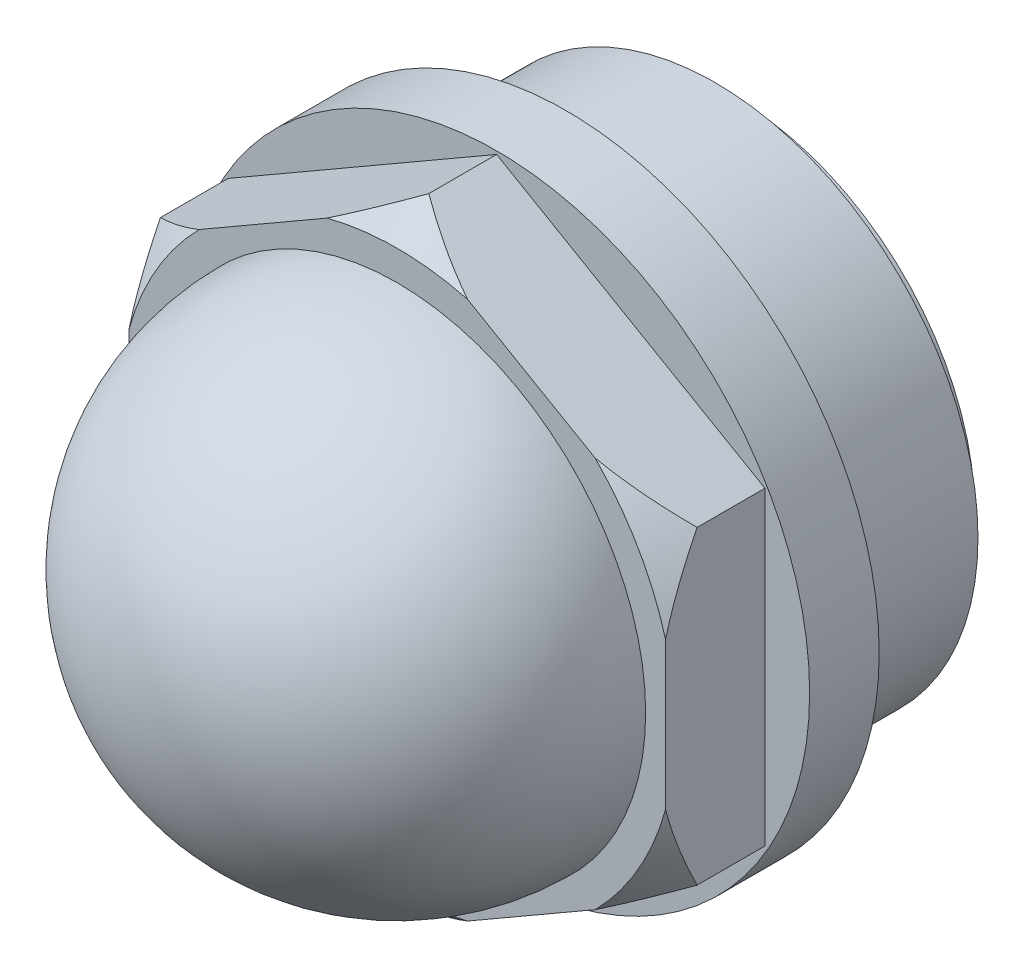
ISO-10303-21;
HEADER;
FILE_DESCRIPTION(('STEP AP214'),'2;1');
FILE_NAME('part.step','',(''),(''),'','','');
FILE_SCHEMA(('AUTOMOTIVE_DESIGN { 1 0 10303 214 1 1 1 1 }'));
ENDSEC;
DATA;
#1=APPLICATION_CONTEXT('core data for automotive mechanical design processes');
#2=APPLICATION_PROTOCOL_DEFINITION('international standard','automotive_design',2000,#1);
#3=PRODUCT_CONTEXT('',#1,'mechanical');
#4=PRODUCT('Part','Part','',(#3));
#5=PRODUCT_RELATED_PRODUCT_CATEGORY('part','',(#4));
#6=PRODUCT_DEFINITION_FORMATION('','',#4);
#7=PRODUCT_DEFINITION_CONTEXT('part definition',#1,'design');
#8=PRODUCT_DEFINITION('design','',#6,#7);
#9=PRODUCT_DEFINITION_SHAPE('','',#8);
#10=(LENGTH_UNIT() NAMED_UNIT(*) SI_UNIT(.MILLI.,.METRE.));
#11=(NAMED_UNIT(*) PLANE_ANGLE_UNIT() SI_UNIT($,.RADIAN.));
#12=(NAMED_UNIT(*) SI_UNIT($,.STERADIAN.) SOLID_ANGLE_UNIT());
#13=UNCERTAINTY_MEASURE_WITH_UNIT(LENGTH_MEASURE(1.E-05),#10,'distance_accuracy_value','');
#14=(GEOMETRIC_REPRESENTATION_CONTEXT(3) GLOBAL_UNCERTAINTY_ASSIGNED_CONTEXT((#13)) GLOBAL_UNIT_ASSIGNED_CONTEXT((#10,
#11,#12)) REPRESENTATION_CONTEXT('',''));
#15=CARTESIAN_POINT('',(0.,0.,0.));
#16=DIRECTION('',(0.,0.,1.));
#17=DIRECTION('',(1.,0.,0.));
#18=AXIS2_PLACEMENT_3D('',#15,#16,#17);
#19=CARTESIAN_POINT('',(0.,0.,-14.5));
#20=DIRECTION('',(0.,0.,-1.));
#21=DIRECTION('',(1.,0.,0.));
#22=AXIS2_PLACEMENT_3D('',#19,#20,#21);
#23=CYLINDRICAL_SURFACE('',#22,15.75);
#24=CARTESIAN_POINT('',(0.,0.,0.));
#25=DIRECTION('',(0.,0.,-1.));
#26=DIRECTION('',(1.,0.,0.));
#27=AXIS2_PLACEMENT_3D('',#24,#25,#26);
#28=CIRCLE('',#27,15.75);
#29=CARTESIAN_POINT('',(15.75,0.,0.));
#30=VERTEX_POINT('',#29);
#31=EDGE_CURVE('E259',#30,#30,#28,.T.);
#32=ORIENTED_EDGE('',*,*,#31,.F.);
#33=EDGE_LOOP('',(#32));
#34=FACE_BOUND('',#33,.T.);
#35=CARTESIAN_POINT('',(0.,0.,3.5));
#36=DIRECTION('',(0.,0.,-1.));
#37=DIRECTION('',(1.,0.,0.));
#38=AXIS2_PLACEMENT_3D('',#35,#36,#37);
#39=CIRCLE('',#38,15.7499999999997);
#40=CARTESIAN_POINT('',(15.7499999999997,0.,3.5));
#41=VERTEX_POINT('',#40);
#42=EDGE_CURVE('E9',#41,#41,#39,.T.);
#43=ORIENTED_EDGE('',*,*,#42,.T.);
#44=EDGE_LOOP('',(#43));
#45=FACE_BOUND('',#44,.T.);
#46=ADVANCED_FACE('F14',(#34,#45),#23,.T.);
#47=CARTESIAN_POINT('',(0.,-15.58845726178,3.5));
#48=DIRECTION('',(0.,0.,-1.));
#49=DIRECTION('',(1.,0.,0.));
#50=AXIS2_PLACEMENT_3D('',#47,#48,#49);
#51=PLANE('',#50);
#52=ORIENTED_EDGE('',*,*,#42,.F.);
#53=EDGE_LOOP('',(#52));
#54=FACE_BOUND('',#53,.T.);
#55=DIRECTION('',(0.,-1.,0.));
#56=VECTOR('',#55,1.);
#57=CARTESIAN_POINT('',(13.4999999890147,7.79422862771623,3.5));
#58=LINE('',#57,#56);
#59=CARTESIAN_POINT('',(13.4999999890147,7.79422862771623,3.5));
#60=VERTEX_POINT('',#59);
#61=CARTESIAN_POINT('',(13.4999999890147,-7.79422862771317,3.5));
#62=VERTEX_POINT('',#61);
#63=EDGE_CURVE('E123',#60,#62,#58,.T.);
#64=ORIENTED_EDGE('',*,*,#63,.T.);
#65=DIRECTION('',(-0.866025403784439,-0.5,0.));
#66=VECTOR('',#65,1.);
#67=CARTESIAN_POINT('',(13.4999999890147,-7.79422862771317,3.5));
#68=LINE('',#67,#66);
#69=CARTESIAN_POINT('',(6.93889390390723E-12,-15.588457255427,3.5));
#70=VERTEX_POINT('',#69);
#71=EDGE_CURVE('E108',#62,#70,#68,.T.);
#72=ORIENTED_EDGE('',*,*,#71,.T.);
#73=DIRECTION('',(-0.866025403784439,0.5,0.));
#74=VECTOR('',#73,1.);
#75=CARTESIAN_POINT('',(6.93889390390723E-12,-15.588457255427,3.5));
#76=LINE('',#75,#74);
#77=CARTESIAN_POINT('',(-13.4999999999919,-7.79422862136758,3.5));
#78=VERTEX_POINT('',#77);
#79=EDGE_CURVE('E120',#70,#78,#76,.T.);
#80=ORIENTED_EDGE('',*,*,#79,.T.);
#81=DIRECTION('',(7.05454887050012E-10,1.,0.));
#82=VECTOR('',#81,1.);
#83=CARTESIAN_POINT('',(-13.4999999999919,-7.79422862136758,3.5));
#84=LINE('',#83,#82);
#85=CARTESIAN_POINT('',(-13.500000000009,7.79422862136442,3.5));
#86=VERTEX_POINT('',#85);
#87=EDGE_CURVE('E128',#78,#86,#84,.T.);
#88=ORIENTED_EDGE('',*,*,#87,.T.);
#89=DIRECTION('',(0.866025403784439,0.5,0.));
#90=VECTOR('',#89,1.);
#91=CARTESIAN_POINT('',(-13.4999999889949,7.79422862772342,3.5));
#92=LINE('',#91,#90);
#93=CARTESIAN_POINT('',(3.60822483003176E-12,15.5884572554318,3.5));
#94=VERTEX_POINT('',#93);
#95=EDGE_CURVE('E28',#86,#94,#92,.T.);
#96=ORIENTED_EDGE('',*,*,#95,.T.);
#97=DIRECTION('',(0.866025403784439,-0.5,0.));
#98=VECTOR('',#97,1.);
#99=CARTESIAN_POINT('',(3.60822483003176E-12,15.5884572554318,3.5));
#100=LINE('',#99,#98);
#101=EDGE_CURVE('E134',#94,#60,#100,.T.);
#102=ORIENTED_EDGE('',*,*,#101,.T.);
#103=EDGE_LOOP('',(#64,#72,#80,#88,#96,#102));
#104=FACE_BOUND('',#103,.T.);
#105=ADVANCED_FACE('F119',(#54,#104),#51,.F.);
#106=CARTESIAN_POINT('',(0.,0.,-8.5));
#107=DIRECTION('',(0.,0.,-1.));
#108=DIRECTION('',(1.,0.,0.));
#109=AXIS2_PLACEMENT_3D('',#106,#107,#108);
#110=PLANE('',#109);
#111=CARTESIAN_POINT('',(0.,0.,-8.5));
#112=DIRECTION('',(0.,0.,-1.));
#113=DIRECTION('',(1.,0.,0.));
#114=AXIS2_PLACEMENT_3D('',#111,#112,#113);
#115=CIRCLE('',#114,12.0585);
#116=CARTESIAN_POINT('',(12.0585,0.,-8.5));
#117=VERTEX_POINT('',#116);
#118=EDGE_CURVE('E272',#117,#117,#115,.T.);
#119=ORIENTED_EDGE('',*,*,#118,.T.);
#120=EDGE_LOOP('',(#119));
#121=FACE_BOUND('',#120,.T.);
#122=ADVANCED_FACE('F254',(#121),#110,.T.);
#123=CARTESIAN_POINT('',(0.,0.,-14.5));
#124=DIRECTION('',(0.,0.,-1.));
#125=DIRECTION('',(1.,0.,0.));
#126=AXIS2_PLACEMENT_3D('',#123,#124,#125);
#127=CYLINDRICAL_SURFACE('',#126,12.0585);
#128=ORIENTED_EDGE('',*,*,#118,.F.);
#129=EDGE_LOOP('',(#128));
#130=FACE_BOUND('',#129,.T.);
#131=CARTESIAN_POINT('',(0.,0.,-7.5));
#132=DIRECTION('',(0.,0.,-1.));
#133=DIRECTION('',(1.,0.,0.));
#134=AXIS2_PLACEMENT_3D('',#131,#132,#133);
#135=CIRCLE('',#134,12.0585);
#136=CARTESIAN_POINT('',(12.0585,0.,-7.5));
#137=VERTEX_POINT('',#136);
#138=EDGE_CURVE('E269',#137,#137,#135,.T.);
#139=ORIENTED_EDGE('',*,*,#138,.T.);
#140=EDGE_LOOP('',(#139));
#141=FACE_BOUND('',#140,.T.);
#142=ADVANCED_FACE('F350',(#130,#141),#127,.T.);
#143=CARTESIAN_POINT('',(0.,-12.0585,-7.5));
#144=DIRECTION('',(0.,0.,-1.));
#145=DIRECTION('',(1.,0.,0.));
#146=AXIS2_PLACEMENT_3D('',#143,#144,#145);
#147=PLANE('',#146);
#148=CARTESIAN_POINT('',(0.,0.,-7.5));
#149=DIRECTION('',(0.,0.,-1.));
#150=DIRECTION('',(1.,0.,0.));
#151=AXIS2_PLACEMENT_3D('',#148,#149,#150);
#152=CIRCLE('',#151,13.2205);
#153=CARTESIAN_POINT('',(13.2205,0.,-7.5));
#154=VERTEX_POINT('',#153);
#155=EDGE_CURVE('E264',#154,#154,#152,.T.);
#156=ORIENTED_EDGE('',*,*,#155,.T.);
#157=EDGE_LOOP('',(#156));
#158=FACE_BOUND('',#157,.T.);
#159=ORIENTED_EDGE('',*,*,#138,.F.);
#160=EDGE_LOOP('',(#159));
#161=FACE_BOUND('',#160,.T.);
#162=ADVANCED_FACE('F346',(#158,#161),#147,.T.);
#163=CARTESIAN_POINT('',(0.,0.,-14.5));
#164=DIRECTION('',(0.,0.,-1.));
#165=DIRECTION('',(1.,0.,0.));
#166=AXIS2_PLACEMENT_3D('',#163,#164,#165);
#167=CYLINDRICAL_SURFACE('',#166,13.2205);
#168=ORIENTED_EDGE('',*,*,#155,.F.);
#169=EDGE_LOOP('',(#168));
#170=FACE_BOUND('',#169,.T.);
#171=CARTESIAN_POINT('',(0.,0.,0.));
#172=DIRECTION('',(0.,0.,-1.));
#173=DIRECTION('',(1.,0.,0.));
#174=AXIS2_PLACEMENT_3D('',#171,#172,#173);
#175=CIRCLE('',#174,13.2205);
#176=CARTESIAN_POINT('',(13.2205,0.,0.));
#177=VERTEX_POINT('',#176);
#178=EDGE_CURVE('E262',#177,#177,#175,.T.);
#179=ORIENTED_EDGE('',*,*,#178,.T.);
#180=EDGE_LOOP('',(#179));
#181=FACE_BOUND('',#180,.T.);
#182=ADVANCED_FACE('F245',(#170,#181),#167,.T.);
#183=CARTESIAN_POINT('',(0.,-15.75,0.));
#184=DIRECTION('',(0.,0.,1.));
#185=DIRECTION('',(-1.,0.,0.));
#186=AXIS2_PLACEMENT_3D('',#183,#184,#185);
#187=PLANE('',#186);
#188=ORIENTED_EDGE('',*,*,#178,.F.);
#189=EDGE_LOOP('',(#188));
#190=FACE_BOUND('',#189,.T.);
#191=ORIENTED_EDGE('',*,*,#31,.T.);
#192=EDGE_LOOP('',(#191));
#193=FACE_BOUND('',#192,.T.);
#194=ADVANCED_FACE('F236',(#190,#193),#187,.F.);
#195=CARTESIAN_POINT('',(13.4999999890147,-7.79422862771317,3.5));
#196=DIRECTION('',(-0.5,0.866025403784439,0.));
#197=DIRECTION('',(0.866025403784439,0.5,0.));
#198=AXIS2_PLACEMENT_3D('',#195,#196,#197);
#199=PLANE('',#198);
#200=DIRECTION('',(0.,0.,1.));
#201=VECTOR('',#200,1.);
#202=CARTESIAN_POINT('',(6.93889390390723E-12,-15.588457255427,3.5));
#203=LINE('',#202,#201);
#204=CARTESIAN_POINT('',(6.93889390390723E-12,-15.588457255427,6.91154274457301));
#205=VERTEX_POINT('',#204);
#206=EDGE_CURVE('E104',#70,#205,#203,.T.);
#207=ORIENTED_EDGE('',*,*,#206,.F.);
#208=ORIENTED_EDGE('',*,*,#71,.F.);
#209=DIRECTION('',(0.,0.,1.));
#210=VECTOR('',#209,1.);
#211=CARTESIAN_POINT('',(13.4999999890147,-7.79422862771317,3.5));
#212=LINE('',#211,#210);
#213=CARTESIAN_POINT('',(13.4999999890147,-7.79422862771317,6.91154274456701));
#214=VERTEX_POINT('',#213);
#215=EDGE_CURVE('E137',#62,#214,#212,.T.);
#216=ORIENTED_EDGE('',*,*,#215,.T.);
#217=CARTESIAN_POINT('',(9.96065417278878,-9.83767088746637,8.5002));
#218=CARTESIAN_POINT('',(10.2676733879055,-9.66041326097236,8.40632414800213));
#219=CARTESIAN_POINT('',(10.5718571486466,-9.48479268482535,8.30078239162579));
#220=CARTESIAN_POINT('',(11.1736119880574,-9.1373693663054,8.06968134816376));
#221=CARTESIAN_POINT('',(11.4711982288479,-8.96555787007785,7.94417492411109));
#222=CARTESIAN_POINT('',(12.0602807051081,-8.62545094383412,7.67600050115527));
#223=CARTESIAN_POINT('',(12.3517797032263,-8.45715391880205,7.53334049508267));
#224=CARTESIAN_POINT('',(12.9298395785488,-8.12341089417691,7.23297953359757));
#225=CARTESIAN_POINT('',(13.2163855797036,-7.95797348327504,7.07524028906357));
#226=CARTESIAN_POINT('',(13.5001999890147,-7.79411315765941,6.91142727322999));
#227=B_SPLINE_CURVE_WITH_KNOTS('',3,(#217,#218,#219,#220,#221,#222,#223,#224,#225,#226),
.UNSPECIFIED.,.F.,.F.,(4,2,2,2,4),(0.,1.09974635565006,2.19662781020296,3.29300013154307,
4.39223429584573),.UNSPECIFIED.);
#228=CARTESIAN_POINT('',(9.96130817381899,-9.83729329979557,8.5));
#229=VERTEX_POINT('',#228);
#230=EDGE_CURVE('E223',#229,#214,#227,.T.);
#231=ORIENTED_EDGE('',*,*,#230,.F.);
#232=DIRECTION('',(-0.866025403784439,-0.5,0.));
#233=VECTOR('',#232,1.);
#234=CARTESIAN_POINT('',(13.4999999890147,-7.79422862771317,8.5));
#235=LINE('',#234,#233);
#236=CARTESIAN_POINT('',(3.53869181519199,-13.5453925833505,8.5));
#237=VERTEX_POINT('',#236);
#238=EDGE_CURVE('E319',#229,#237,#235,.T.);
#239=ORIENTED_EDGE('',*,*,#238,.T.);
#240=CARTESIAN_POINT('',(-0.000199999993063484,-15.588572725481,6.91142727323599));
#241=CARTESIAN_POINT('',(0.28361440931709,-15.4247123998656,7.07524028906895));
#242=CARTESIAN_POINT('',(0.570160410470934,-15.2592749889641,7.23297953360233));
#243=CARTESIAN_POINT('',(1.14822028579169,-14.9255319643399,7.53334049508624));
#244=CARTESIAN_POINT('',(1.43971928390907,-14.7572349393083,7.67600050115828));
#245=CARTESIAN_POINT('',(2.02880176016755,-14.4171280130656,7.94417492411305));
#246=CARTESIAN_POINT('',(2.32638800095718,-14.2453165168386,8.06968134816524));
#247=CARTESIAN_POINT('',(2.92814284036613,-13.8978931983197,8.30078239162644));
#248=CARTESIAN_POINT('',(3.23232660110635,-13.7222726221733,8.40632414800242));
#249=CARTESIAN_POINT('',(3.53934581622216,-13.54501499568,8.5002));
#250=B_SPLINE_CURVE_WITH_KNOTS('',3,(#240,#241,#242,#243,#244,#245,#246,#247,#248,#249),
.UNSPECIFIED.,.F.,.F.,(4,2,2,2,4),(0.,1.09923416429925,2.19560648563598,3.29248794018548,
4.39223429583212),.UNSPECIFIED.);
#251=EDGE_CURVE('E110',#205,#237,#250,.T.);
#252=ORIENTED_EDGE('',*,*,#251,.F.);
#253=EDGE_LOOP('',(#207,#208,#216,#231,#239,#252));
#254=FACE_BOUND('',#253,.T.);
#255=ADVANCED_FACE('F106',(#254),#199,.F.);
#256=CARTESIAN_POINT('',(6.93889390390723E-12,-15.588457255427,3.5));
#257=DIRECTION('',(0.5,0.866025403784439,0.));
#258=DIRECTION('',(0.866025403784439,-0.5,0.));
#259=AXIS2_PLACEMENT_3D('',#256,#257,#258);
#260=PLANE('',#259);
#261=DIRECTION('',(0.,0.,1.));
#262=VECTOR('',#261,1.);
#263=CARTESIAN_POINT('',(-13.4999999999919,-7.79422862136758,3.5));
#264=LINE('',#263,#262);
#265=CARTESIAN_POINT('',(-13.4999999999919,-7.79422862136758,6.911542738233));
#266=VERTEX_POINT('',#265);
#267=EDGE_CURVE('E114',#78,#266,#264,.T.);
#268=ORIENTED_EDGE('',*,*,#267,.F.);
#269=ORIENTED_EDGE('',*,*,#79,.F.);
#270=ORIENTED_EDGE('',*,*,#206,.T.);
#271=CARTESIAN_POINT('',(-3.53934581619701,-13.5450149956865,8.5002));
#272=CARTESIAN_POINT('',(-3.23232660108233,-13.7222726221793,8.406324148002));
#273=CARTESIAN_POINT('',(-2.92814284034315,-13.8978931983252,8.30078239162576));
#274=CARTESIAN_POINT('',(-2.32638800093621,-14.245316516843,8.06968134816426));
#275=CARTESIAN_POINT('',(-2.02880176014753,-14.4171280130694,7.94417492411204));
#276=CARTESIAN_POINT('',(-1.43971928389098,-14.7572349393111,7.67600050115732));
#277=CARTESIAN_POINT('',(-1.14822028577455,-14.9255319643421,7.53334049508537));
#278=CARTESIAN_POINT('',(-0.570160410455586,-15.2592749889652,7.23297953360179));
#279=CARTESIAN_POINT('',(-0.283614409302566,-15.424712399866,7.07524028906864));
#280=CARTESIAN_POINT('',(0.000200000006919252,-15.5885727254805,6.91142727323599));
#281=B_SPLINE_CURVE_WITH_KNOTS('',3,(#271,#272,#273,#274,#275,#276,#277,#278,#279,#280),
.UNSPECIFIED.,.F.,.F.,(4,2,2,2,4),(0.,1.09974635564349,2.19662781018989,3.29300013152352,
4.39223429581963),.UNSPECIFIED.);
#282=CARTESIAN_POINT('',(-3.53869181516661,-13.5453925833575,8.5));
#283=VERTEX_POINT('',#282);
#284=EDGE_CURVE('E210',#283,#205,#281,.T.);
#285=ORIENTED_EDGE('',*,*,#284,.F.);
#286=DIRECTION('',(-0.866025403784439,0.5,0.));
#287=VECTOR('',#286,1.);
#288=CARTESIAN_POINT('',(6.93889390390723E-12,-15.588457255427,8.5));
#289=LINE('',#288,#287);
#290=CARTESIAN_POINT('',(-9.96130817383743,-9.83729329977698,8.5));
#291=VERTEX_POINT('',#290);
#292=EDGE_CURVE('E311',#283,#291,#289,.T.);
#293=ORIENTED_EDGE('',*,*,#292,.T.);
#294=CARTESIAN_POINT('',(-13.5001999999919,-7.79411315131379,6.911427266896));
#295=CARTESIAN_POINT('',(-13.2163855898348,-7.95797347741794,7.07524028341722));
#296=CARTESIAN_POINT('',(-12.9298395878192,-8.12341088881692,7.23297952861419));
#297=CARTESIAN_POINT('',(-12.3517797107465,-8.45715391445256,7.53334049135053));
#298=CARTESIAN_POINT('',(-12.0602807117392,-8.62545093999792,7.67600049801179));
#299=CARTESIAN_POINT('',(-11.4711982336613,-8.96555786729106,7.94417492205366));
#300=CARTESIAN_POINT('',(-11.1736119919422,-9.13736936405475,8.06968134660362));
#301=CARTESIAN_POINT('',(-10.57185715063,-9.48479268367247,8.30078239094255));
#302=CARTESIAN_POINT('',(-10.2676733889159,-9.6604132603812,8.40632414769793));
#303=CARTESIAN_POINT('',(-9.96065417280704,-9.83767088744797,8.5002));
#304=B_SPLINE_CURVE_WITH_KNOTS('',3,(#294,#295,#296,#297,#298,#299,#300,#301,#302,#303),
.UNSPECIFIED.,.F.,.F.,(4,2,2,2,4),(0.,1.09923416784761,2.19560649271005,3.29248795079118,
4.39223430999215),.UNSPECIFIED.);
#305=EDGE_CURVE('E217',#266,#291,#304,.T.);
#306=ORIENTED_EDGE('',*,*,#305,.F.);
#307=EDGE_LOOP('',(#268,#269,#270,#285,#293,#306));
#308=FACE_BOUND('',#307,.T.);
#309=ADVANCED_FACE('F126',(#308),#260,.F.);
#310=CARTESIAN_POINT('',(-13.4999999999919,-7.79422862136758,3.5));
#311=DIRECTION('',(1.,-7.05454887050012E-10,0.));
#312=DIRECTION('',(-7.05454887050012E-10,-1.,0.));
#313=AXIS2_PLACEMENT_3D('',#310,#311,#312);
#314=PLANE('',#313);
#315=DIRECTION('',(0.,0.,1.));
#316=VECTOR('',#315,1.);
#317=CARTESIAN_POINT('',(-13.4999999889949,7.79422862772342,3.5));
#318=LINE('',#317,#316);
#319=CARTESIAN_POINT('',(-13.4999999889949,7.79422862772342,6.911542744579));
#320=VERTEX_POINT('',#319);
#321=EDGE_CURVE('E144',#86,#320,#318,.T.);
#322=ORIENTED_EDGE('',*,*,#321,.F.);
#323=ORIENTED_EDGE('',*,*,#87,.F.);
#324=ORIENTED_EDGE('',*,*,#267,.T.);
#325=CARTESIAN_POINT('',(-13.4999999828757,16.4684622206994,1.205393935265));
#326=CARTESIAN_POINT('',(-13.4999999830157,16.2699224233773,1.35893468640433));
#327=CARTESIAN_POINT('',(-13.4999999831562,16.070845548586,1.51178045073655));
#328=CARTESIAN_POINT('',(-13.4999999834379,15.6715264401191,1.81594846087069));
#329=CARTESIAN_POINT('',(-13.4999999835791,15.4712841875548,1.96727068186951));
#330=CARTESIAN_POINT('',(-13.4999999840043,14.8685949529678,2.4188096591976));
#331=CARTESIAN_POINT('',(-13.4999999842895,14.4642717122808,2.71653187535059));
#332=CARTESIAN_POINT('',(-13.4999999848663,13.6466905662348,3.30621586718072));
#333=CARTESIAN_POINT('',(-13.4999999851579,13.2333878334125,3.59811562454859));
#334=CARTESIAN_POINT('',(-13.4999999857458,12.3999450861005,4.17195347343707));
#335=CARTESIAN_POINT('',(-13.4999999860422,11.9798055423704,4.45389224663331));
#336=CARTESIAN_POINT('',(-13.4999999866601,11.103872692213,5.02349880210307));
#337=CARTESIAN_POINT('',(-13.4999999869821,10.6475405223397,5.31034201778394));
#338=CARTESIAN_POINT('',(-13.4999999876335,9.7241472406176,5.86650524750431));
#339=CARTESIAN_POINT('',(-13.499999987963,9.25708431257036,6.13582226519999));
#340=CARTESIAN_POINT('',(-13.4999999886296,8.31205720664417,6.65121867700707));
#341=CARTESIAN_POINT('',(-13.4999999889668,7.83413048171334,6.89736621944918));
#342=CARTESIAN_POINT('',(-13.4999999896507,6.86463344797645,7.36090871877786));
#343=CARTESIAN_POINT('',(-13.4999999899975,6.37306978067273,7.57831738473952));
#344=CARTESIAN_POINT('',(-13.4999999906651,5.42676232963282,7.95587563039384));
#345=CARTESIAN_POINT('',(-13.4999999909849,4.9734650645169,8.11962100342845));
#346=CARTESIAN_POINT('',(-13.4999999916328,4.05505996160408,8.41084680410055));
#347=CARTESIAN_POINT('',(-13.4999999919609,3.58995138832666,8.53832496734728));
#348=CARTESIAN_POINT('',(-13.4999999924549,2.88960421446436,8.69604084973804));
#349=CARTESIAN_POINT('',(-13.4999999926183,2.65800620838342,8.74272758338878));
#350=CARTESIAN_POINT('',(-13.4999999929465,2.19285403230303,8.82497677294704));
#351=CARTESIAN_POINT('',(-13.4999999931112,1.95930014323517,8.86054079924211));
#352=CARTESIAN_POINT('',(-13.4999999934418,1.49072307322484,8.91993202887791));
#353=CARTESIAN_POINT('',(-13.4999999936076,1.25570003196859,8.94376033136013));
#354=CARTESIAN_POINT('',(-13.4999999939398,0.784733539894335,8.97925001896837));
#355=CARTESIAN_POINT('',(-13.4999999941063,0.548790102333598,8.99091157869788));
#356=CARTESIAN_POINT('',(-13.4999999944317,0.0874807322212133,9.00159459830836));
#357=CARTESIAN_POINT('',(-13.4999999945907,-0.137872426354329,9.00117291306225));
#358=CARTESIAN_POINT('',(-13.4999999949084,-0.588299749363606,8.98906356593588));
#359=CARTESIAN_POINT('',(-13.4999999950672,-0.813373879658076,8.97737464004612));
#360=CARTESIAN_POINT('',(-13.4999999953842,-1.26265893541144,8.94292979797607));
#361=CARTESIAN_POINT('',(-13.4999999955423,-1.4868699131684,8.92017456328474));
#362=CARTESIAN_POINT('',(-13.4999999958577,-1.93395988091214,8.86398306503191));
#363=CARTESIAN_POINT('',(-13.499999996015,-2.15683868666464,8.83054535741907));
#364=CARTESIAN_POINT('',(-13.4999999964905,-2.83085033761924,8.71356149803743));
#365=CARTESIAN_POINT('',(-13.4999999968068,-3.27927332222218,8.61398877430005));
#366=CARTESIAN_POINT('',(-13.4999999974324,-4.16612729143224,8.37826247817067));
#367=CARTESIAN_POINT('',(-13.4999999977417,-4.60455876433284,8.24211069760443));
#368=CARTESIAN_POINT('',(-13.4999999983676,-5.4917973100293,7.93192864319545));
#369=CARTESIAN_POINT('',(-13.4999999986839,-5.94006621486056,7.75637383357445));
#370=CARTESIAN_POINT('',(-13.4999999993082,-6.82509065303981,7.37810709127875));
#371=CARTESIAN_POINT('',(-13.4999999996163,-7.26184093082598,7.1753830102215));
#372=CARTESIAN_POINT('',(-13.5000000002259,-8.12588303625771,6.74758290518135));
#373=CARTESIAN_POINT('',(-13.5000000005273,-8.55314067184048,6.52243837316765));
#374=CARTESIAN_POINT('',(-13.5000000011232,-9.39787394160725,6.05474673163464));
#375=CARTESIAN_POINT('',(-13.5000000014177,-9.81535105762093,5.81220228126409));
#376=CARTESIAN_POINT('',(-13.5000000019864,-10.6214190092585,5.32540999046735));
#377=CARTESIAN_POINT('',(-13.5000000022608,-11.0104190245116,5.08183612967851));
#378=CARTESIAN_POINT('',(-13.5000000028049,-11.781734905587,4.58429511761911));
#379=CARTESIAN_POINT('',(-13.5000000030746,-12.1640502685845,4.33032718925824));
#380=CARTESIAN_POINT('',(-13.5000000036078,-12.9198040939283,3.81591116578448));
#381=CARTESIAN_POINT('',(-13.5000000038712,-13.2932891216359,3.55553123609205));
#382=CARTESIAN_POINT('',(-13.5000000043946,-14.0351316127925,3.02777213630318));
#383=CARTESIAN_POINT('',(-13.5000000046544,-14.4034904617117,2.76039491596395));
#384=CARTESIAN_POINT('',(-13.5000000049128,-14.769698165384,2.490152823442));
#385=B_SPLINE_CURVE_WITH_KNOTS('',3,(#325,#326,#327,#328,#329,#330,#331,#332,#333,#334,#335,
#336,#337,#338,#339,#340,#341,#342,#343,#344,#345,#346,#347,#348,#349,#350,#351,#352,#353,#354,
#355,#356,#357,#358,#359,#360,#361,#362,#363,#364,#365,#366,#367,#368,#369,#370,#371,#372,#373,
#374,#375,#376,#377,#378,#379,#380,#381,#382,#383,#384),.UNSPECIFIED.,.F.,.F.,(4,2,2,2,2,2,2,2,
2,2,2,2,2,2,2,2,2,2,2,2,2,2,2,2,2,2,2,2,2,4),(0.,0.752948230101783,1.50590869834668,
3.01215690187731,4.53000481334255,6.04774864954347,7.66442810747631,9.28138323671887,
10.8934232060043,12.5046914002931,13.9494013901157,15.3942015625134,16.1027476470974,
16.8111936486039,17.5195732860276,18.2279427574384,18.9037219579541,19.5795769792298,
20.2553903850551,20.9312951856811,22.3073392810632,23.6833159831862,25.1264572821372,
26.5702460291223,28.0185903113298,29.466713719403,30.8434163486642,32.2202220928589,
33.5860042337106,34.9514097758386),.UNSPECIFIED.);
#386=CARTESIAN_POINT('',(-13.4999999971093,-3.70809925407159,8.5));
#387=VERTEX_POINT('',#386);
#388=EDGE_CURVE('E202',#387,#266,#385,.T.);
#389=ORIENTED_EDGE('',*,*,#388,.F.);
#390=DIRECTION('',(7.05454887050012E-10,1.,0.));
#391=VECTOR('',#390,1.);
#392=CARTESIAN_POINT('',(-13.4999999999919,-7.79422862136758,8.5));
#393=LINE('',#392,#391);
#394=CARTESIAN_POINT('',(-13.4999999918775,3.70809927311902,8.5));
#395=VERTEX_POINT('',#394);
#396=EDGE_CURVE('E312',#387,#395,#393,.T.);
#397=ORIENTED_EDGE('',*,*,#396,.T.);
#398=EDGE_CURVE('E325',#320,#395,#385,.T.);
#399=ORIENTED_EDGE('',*,*,#398,.F.);
#400=EDGE_LOOP('',(#322,#323,#324,#389,#397,#399));
#401=FACE_BOUND('',#400,.T.);
#402=ADVANCED_FACE('F244',(#401),#314,.F.);
#403=CARTESIAN_POINT('',(-13.4999999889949,7.79422862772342,3.5));
#404=DIRECTION('',(0.5,-0.866025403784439,0.));
#405=DIRECTION('',(-0.866025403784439,-0.5,0.));
#406=AXIS2_PLACEMENT_3D('',#403,#404,#405);
#407=PLANE('',#406);
#408=DIRECTION('',(0.,0.,1.));
#409=VECTOR('',#408,1.);
#410=CARTESIAN_POINT('',(3.60822483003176E-12,15.5884572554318,3.5));
#411=LINE('',#410,#409);
#412=CARTESIAN_POINT('',(3.60822483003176E-12,15.5884572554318,6.91154274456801));
#413=VERTEX_POINT('',#412);
#414=EDGE_CURVE('E141',#94,#413,#411,.T.);
#415=ORIENTED_EDGE('',*,*,#414,.F.);
#416=ORIENTED_EDGE('',*,*,#95,.F.);
#417=ORIENTED_EDGE('',*,*,#321,.T.);
#418=CARTESIAN_POINT('',(-9.96065417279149,9.83767088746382,8.5002));
#419=CARTESIAN_POINT('',(-10.2676733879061,9.6604132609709,8.40632414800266));
#420=CARTESIAN_POINT('',(-10.5718571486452,9.48479268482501,8.300782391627));
#421=CARTESIAN_POINT('',(-11.1736119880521,9.13736936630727,8.06968134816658));
#422=CARTESIAN_POINT('',(-11.4711982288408,8.96555787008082,7.94417492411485));
#423=CARTESIAN_POINT('',(-12.0602807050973,8.62545094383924,7.67600050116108));
#424=CARTESIAN_POINT('',(-12.3517797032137,8.45715391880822,7.5333404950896));
#425=CARTESIAN_POINT('',(-12.9298395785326,8.12341089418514,7.23297953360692));
#426=CARTESIAN_POINT('',(-13.2163855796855,7.95797348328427,7.0752402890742));
#427=CARTESIAN_POINT('',(-13.5001999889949,7.79411315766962,6.91142727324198));
#428=B_SPLINE_CURVE_WITH_KNOTS('',3,(#418,#419,#420,#421,#422,#423,#424,#425,#426,#427),
.UNSPECIFIED.,.F.,.F.,(4,2,2,2,4),(0.,1.09974635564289,2.19662781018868,3.29300013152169,
4.39223429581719),.UNSPECIFIED.);
#429=CARTESIAN_POINT('',(-9.96130817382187,9.83729329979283,8.5));
#430=VERTEX_POINT('',#429);
#431=EDGE_CURVE('E187',#430,#320,#428,.T.);
#432=ORIENTED_EDGE('',*,*,#431,.F.);
#433=DIRECTION('',(0.866025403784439,0.5,0.));
#434=VECTOR('',#433,1.);
#435=CARTESIAN_POINT('',(-13.4999999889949,7.79422862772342,8.5));
#436=LINE('',#435,#434);
#437=CARTESIAN_POINT('',(-3.53869181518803,13.5453925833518,8.5));
#438=VERTEX_POINT('',#437);
#439=EDGE_CURVE('E315',#430,#438,#436,.T.);
#440=ORIENTED_EDGE('',*,*,#439,.T.);
#441=CARTESIAN_POINT('',(0.000200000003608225,15.5885727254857,6.91142727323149));
#442=CARTESIAN_POINT('',(-0.283614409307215,15.4247123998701,7.07524028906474));
#443=CARTESIAN_POINT('',(-0.570160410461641,15.2592749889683,7.23297953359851));
#444=CARTESIAN_POINT('',(-1.1482202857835,14.9255319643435,7.53334049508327));
#445=CARTESIAN_POINT('',(-1.4397192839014,14.7572349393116,7.67600050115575));
#446=CARTESIAN_POINT('',(-2.02880176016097,14.4171280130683,7.94417492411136));
#447=CARTESIAN_POINT('',(-2.32638800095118,14.2453165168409,8.06968134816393));
#448=CARTESIAN_POINT('',(-2.92814284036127,13.8978931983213,8.30078239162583));
#449=CARTESIAN_POINT('',(-3.23232660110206,13.7222726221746,8.40632414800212));
#450=CARTESIAN_POINT('',(-3.53934581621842,13.5450149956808,8.5002));
#451=B_SPLINE_CURVE_WITH_KNOTS('',3,(#441,#442,#443,#444,#445,#446,#447,#448,#449,#450),
.UNSPECIFIED.,.F.,.F.,(4,2,2,2,4),(0.,1.09923416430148,2.19560648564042,3.29248794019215,
4.39223429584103),.UNSPECIFIED.);
#452=EDGE_CURVE('E195',#413,#438,#451,.T.);
#453=ORIENTED_EDGE('',*,*,#452,.F.);
#454=EDGE_LOOP('',(#415,#416,#417,#432,#440,#453));
#455=FACE_BOUND('',#454,.T.);
#456=ADVANCED_FACE('F332',(#455),#407,.F.);
#457=CARTESIAN_POINT('',(3.60822483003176E-12,15.5884572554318,3.5));
#458=DIRECTION('',(-0.5,-0.866025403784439,0.));
#459=DIRECTION('',(-0.866025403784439,0.5,0.));
#460=AXIS2_PLACEMENT_3D('',#457,#458,#459);
#461=PLANE('',#460);
#462=DIRECTION('',(0.,0.,1.));
#463=VECTOR('',#462,1.);
#464=CARTESIAN_POINT('',(13.4999999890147,7.79422862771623,3.5));
#465=LINE('',#464,#463);
#466=CARTESIAN_POINT('',(13.4999999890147,7.79422862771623,6.91154274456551));
#467=VERTEX_POINT('',#466);
#468=EDGE_CURVE('E139',#60,#467,#465,.T.);
#469=ORIENTED_EDGE('',*,*,#468,.F.);
#470=ORIENTED_EDGE('',*,*,#101,.F.);
#471=ORIENTED_EDGE('',*,*,#414,.T.);
#472=CARTESIAN_POINT('',(3.53934581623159,13.5450149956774,8.5002));
#473=CARTESIAN_POINT('',(3.23232660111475,13.7222726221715,8.40632414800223));
#474=CARTESIAN_POINT('',(2.92814284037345,13.8978931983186,8.30078239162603));
#475=CARTESIAN_POINT('',(2.32638800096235,14.2453165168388,8.06968134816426));
#476=CARTESIAN_POINT('',(2.02880176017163,14.4171280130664,7.94417492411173));
#477=CARTESIAN_POINT('',(1.43971928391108,14.7572349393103,7.67600050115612));
#478=CARTESIAN_POINT('',(1.1482202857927,14.9255319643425,7.53334049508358));
#479=CARTESIAN_POINT('',(0.57016041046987,15.2592749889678,7.23297953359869));
#480=CARTESIAN_POINT('',(0.283614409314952,15.4247123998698,7.07524028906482));
#481=CARTESIAN_POINT('',(-0.000199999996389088,15.5885727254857,6.91142727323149));
#482=B_SPLINE_CURVE_WITH_KNOTS('',3,(#472,#473,#474,#475,#476,#477,#478,#479,#480,#481),
.UNSPECIFIED.,.F.,.F.,(4,2,2,2,4),(0.,1.09974635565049,2.19662781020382,3.29300013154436,
4.39223429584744),.UNSPECIFIED.);
#483=CARTESIAN_POINT('',(3.53869181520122,13.5453925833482,8.5));
#484=VERTEX_POINT('',#483);
#485=EDGE_CURVE('E155',#484,#413,#482,.T.);
#486=ORIENTED_EDGE('',*,*,#485,.F.);
#487=DIRECTION('',(0.866025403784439,-0.5,0.));
#488=VECTOR('',#487,1.);
#489=CARTESIAN_POINT('',(3.60822483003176E-12,15.5884572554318,8.5));
#490=LINE('',#489,#488);
#491=CARTESIAN_POINT('',(9.96130817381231,9.83729329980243,8.5));
#492=VERTEX_POINT('',#491);
#493=EDGE_CURVE('E317',#484,#492,#490,.T.);
#494=ORIENTED_EDGE('',*,*,#493,.T.);
#495=CARTESIAN_POINT('',(13.5001999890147,7.7941131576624,6.91142727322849));
#496=CARTESIAN_POINT('',(13.216385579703,7.95797348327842,7.07524028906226));
#497=CARTESIAN_POINT('',(12.9298395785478,8.12341089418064,7.23297953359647));
#498=CARTESIAN_POINT('',(12.3517797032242,8.45715391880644,7.53334049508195));
#499=CARTESIAN_POINT('',(12.0602807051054,8.62545094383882,7.67600050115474));
#500=CARTESIAN_POINT('',(11.4711982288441,8.96555787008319,7.94417492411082));
#501=CARTESIAN_POINT('',(11.173611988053,9.13736936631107,8.06968134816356));
#502=CARTESIAN_POINT('',(10.571857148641,9.48479268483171,8.30078239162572));
#503=CARTESIAN_POINT('',(10.2676733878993,9.66041326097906,8.40632414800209));
#504=CARTESIAN_POINT('',(9.96065417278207,9.83767088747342,8.5002));
#505=B_SPLINE_CURVE_WITH_KNOTS('',3,(#495,#496,#497,#498,#499,#500,#501,#502,#503,#504),
.UNSPECIFIED.,.F.,.F.,(4,2,2,2,4),(0.,1.09923416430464,2.19560648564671,3.29248794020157,
4.39223429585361),.UNSPECIFIED.);
#506=EDGE_CURVE('E180',#467,#492,#505,.T.);
#507=ORIENTED_EDGE('',*,*,#506,.F.);
#508=EDGE_LOOP('',(#469,#470,#471,#486,#494,#507));
#509=FACE_BOUND('',#508,.T.);
#510=ADVANCED_FACE('F330',(#509),#461,.F.);
#511=CARTESIAN_POINT('',(13.4999999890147,7.79422862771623,3.5));
#512=DIRECTION('',(-1.,0.,0.));
#513=DIRECTION('',(0.,0.,-1.));
#514=AXIS2_PLACEMENT_3D('',#511,#512,#513);
#515=PLANE('',#514);
#516=ORIENTED_EDGE('',*,*,#215,.F.);
#517=ORIENTED_EDGE('',*,*,#63,.F.);
#518=ORIENTED_EDGE('',*,*,#468,.T.);
#519=CARTESIAN_POINT('',(13.4999999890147,16.4684622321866,1.2053939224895));
#520=CARTESIAN_POINT('',(13.4999999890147,16.2699224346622,1.35893467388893));
#521=CARTESIAN_POINT('',(13.4999999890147,16.0708455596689,1.51178043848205));
#522=CARTESIAN_POINT('',(13.4999999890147,15.6715264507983,1.81594844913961));
#523=CARTESIAN_POINT('',(13.4999999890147,15.4712841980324,1.96727067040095));
#524=CARTESIAN_POINT('',(13.4999999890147,14.8685949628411,2.41880964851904));
#525=CARTESIAN_POINT('',(13.4999999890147,14.4642717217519,2.71653186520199));
#526=CARTESIAN_POINT('',(13.4999999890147,13.6466905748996,3.3062158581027));
#527=CARTESIAN_POINT('',(13.4999999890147,13.2333878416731,3.59811561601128));
#528=CARTESIAN_POINT('',(13.4999999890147,12.3999450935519,4.1719534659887));
#529=CARTESIAN_POINT('',(13.4999999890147,11.9798055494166,4.45389223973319));
#530=CARTESIAN_POINT('',(13.4999999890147,11.1038726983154,5.02349879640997));
#531=CARTESIAN_POINT('',(13.4999999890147,10.647540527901,5.31034201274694));
#532=CARTESIAN_POINT('',(13.4999999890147,9.72414724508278,5.86650524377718));
#533=CARTESIAN_POINT('',(13.4999999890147,9.25708431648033,6.13582226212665));
#534=CARTESIAN_POINT('',(13.4999999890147,8.31205720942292,6.6512186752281));
#535=CARTESIAN_POINT('',(13.4999999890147,7.83413048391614,6.89736621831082));
#536=CARTESIAN_POINT('',(13.4999999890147,6.86463344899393,7.36090871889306));
#537=CARTESIAN_POINT('',(13.4999999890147,6.37306978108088,7.57831738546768));
#538=CARTESIAN_POINT('',(13.4999999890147,5.42676232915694,7.95587563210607));
#539=CARTESIAN_POINT('',(13.4999999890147,4.9734650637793,8.11962100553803));
#540=CARTESIAN_POINT('',(13.4999999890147,4.05505996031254,8.4108468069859));
#541=CARTESIAN_POINT('',(13.4999999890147,3.58995138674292,8.53832497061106));
#542=CARTESIAN_POINT('',(13.4999999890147,2.88960421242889,8.69604085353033));
#543=CARTESIAN_POINT('',(13.4999999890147,2.65800620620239,8.74272758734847));
#544=CARTESIAN_POINT('',(13.4999999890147,2.19285402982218,8.82497677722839));
#545=CARTESIAN_POINT('',(13.4999999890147,1.95930014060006,8.86054080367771));
#546=CARTESIAN_POINT('',(13.4999999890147,1.49072307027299,8.91993203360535));
#547=CARTESIAN_POINT('',(13.4999999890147,1.25570002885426,8.94376033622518));
#548=CARTESIAN_POINT('',(13.4999999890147,0.784733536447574,8.97925002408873));
#549=CARTESIAN_POINT('',(13.4999999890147,0.548790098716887,8.99091158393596));
#550=CARTESIAN_POINT('',(13.4999999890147,0.087480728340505,9.00159460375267));
#551=CARTESIAN_POINT('',(13.4999999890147,-0.137872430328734,9.00117291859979));
#552=CARTESIAN_POINT('',(13.4999999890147,-0.588299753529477,8.98906357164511));
#553=CARTESIAN_POINT('',(13.4999999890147,-0.813373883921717,8.97737464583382));
#554=CARTESIAN_POINT('',(13.4999999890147,-1.26265893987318,8.94292980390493));
#555=CARTESIAN_POINT('',(13.4999999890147,-1.48686991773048,8.9201745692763));
#556=CARTESIAN_POINT('',(13.4999999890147,-1.93395988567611,8.86398307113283));
#557=CARTESIAN_POINT('',(13.4999999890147,-2.15683869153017,8.83054536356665));
#558=CARTESIAN_POINT('',(13.4999999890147,-2.83085034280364,8.71356150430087));
#559=CARTESIAN_POINT('',(13.4999999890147,-3.27927332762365,8.61398878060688));
#560=CARTESIAN_POINT('',(13.4999999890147,-4.16612729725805,8.37826248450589));
#561=CARTESIAN_POINT('',(13.4999999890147,-4.60455877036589,8.24211070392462));
#562=CARTESIAN_POINT('',(13.4999999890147,-5.49179731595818,7.93192864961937));
#563=CARTESIAN_POINT('',(13.4999999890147,-5.94006622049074,7.75637384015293));
#564=CARTESIAN_POINT('',(13.4999999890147,-6.82509065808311,7.37810709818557));
#565=CARTESIAN_POINT('',(13.4999999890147,-7.2618409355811,7.17538301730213));
#566=CARTESIAN_POINT('',(13.4999999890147,-8.12588304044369,6.74758291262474));
#567=CARTESIAN_POINT('',(13.4999999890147,-8.55314067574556,6.52243838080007));
#568=CARTESIAN_POINT('',(13.4999999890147,-9.39787394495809,6.05474673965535));
#569=CARTESIAN_POINT('',(13.4999999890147,-9.81535106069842,5.81220228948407));
#570=CARTESIAN_POINT('',(13.4999999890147,-10.6214190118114,5.32540999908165));
#571=CARTESIAN_POINT('',(13.4999999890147,-11.0104190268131,5.08183613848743));
#572=CARTESIAN_POINT('',(13.4999999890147,-11.7817349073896,4.58429512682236));
#573=CARTESIAN_POINT('',(13.4999999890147,-12.1640502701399,4.3303271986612));
#574=CARTESIAN_POINT('',(13.4999999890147,-12.9198040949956,3.81591117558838));
#575=CARTESIAN_POINT('',(13.4999999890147,-13.2932891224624,3.55553124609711));
#576=CARTESIAN_POINT('',(13.4999999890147,-14.0351316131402,3.0277721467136));
#577=CARTESIAN_POINT('',(13.4999999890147,-14.4034904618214,2.76039492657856));
#578=CARTESIAN_POINT('',(13.4999999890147,-14.769698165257,2.49015283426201));
#579=B_SPLINE_CURVE_WITH_KNOTS('',3,(#519,#520,#521,#522,#523,#524,#525,#526,#527,#528,#529,
#530,#531,#532,#533,#534,#535,#536,#537,#538,#539,#540,#541,#542,#543,#544,#545,#546,#547,#548,
#549,#550,#551,#552,#553,#554,#555,#556,#557,#558,#559,#560,#561,#562,#563,#564,#565,#566,#567,
#568,#569,#570,#571,#572,#573,#574,#575,#576,#577,#578),.UNSPECIFIED.,.F.,.F.,(4,2,2,2,2,2,2,2,
2,2,2,2,2,2,2,2,2,2,2,2,2,2,2,2,2,2,2,2,2,4),(0.,0.752948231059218,1.50590870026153,
3.01215690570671,4.53000481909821,6.04774865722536,7.66442811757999,9.28138324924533,
10.8934232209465,12.5046914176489,13.949401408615,15.3942015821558,16.1027476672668,
16.8111936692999,17.5195733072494,18.2279427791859,18.9037219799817,19.5795770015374,
20.2553904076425,20.9312952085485,22.3073393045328,23.6833160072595,25.1264573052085,
26.5702460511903,28.0185903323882,29.4667137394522,30.8434163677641,32.2202221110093,
33.5860042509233,34.9514097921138),.UNSPECIFIED.);
#580=CARTESIAN_POINT('',(13.4999999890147,3.70809928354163,8.5));
#581=VERTEX_POINT('',#580);
#582=EDGE_CURVE('E36',#581,#467,#579,.F.);
#583=ORIENTED_EDGE('',*,*,#582,.F.);
#584=DIRECTION('',(0.,-1.,0.));
#585=VECTOR('',#584,1.);
#586=CARTESIAN_POINT('',(13.4999999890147,7.79422862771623,8.5));
#587=LINE('',#586,#585);
#588=CARTESIAN_POINT('',(13.4999999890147,-3.70809928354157,8.5));
#589=VERTEX_POINT('',#588);
#590=EDGE_CURVE('E124',#581,#589,#587,.T.);
#591=ORIENTED_EDGE('',*,*,#590,.T.);
#592=EDGE_CURVE('E154',#214,#589,#579,.F.);
#593=ORIENTED_EDGE('',*,*,#592,.F.);
#594=EDGE_LOOP('',(#516,#517,#518,#583,#591,#593));
#595=FACE_BOUND('',#594,.T.);
#596=ADVANCED_FACE('F162',(#595),#515,.F.);
#597=CARTESIAN_POINT('',(0.,0.,8.5));
#598=DIRECTION('',(-1.,0.,0.));
#599=DIRECTION('',(0.,0.,-1.));
#600=AXIS2_PLACEMENT_3D('',#597,#598,#599);
#601=SPHERICAL_SURFACE('',#600,12.5);
#602=CARTESIAN_POINT('',(0.,0.,8.5));
#603=DIRECTION('',(0.,0.,-1.));
#604=DIRECTION('',(1.,0.,0.));
#605=AXIS2_PLACEMENT_3D('',#602,#603,#604);
#606=SPHERICAL_SURFACE('',#605,12.5);
#607=CARTESIAN_POINT('',(0.,0.,8.5));
#608=DIRECTION('',(0.,0.,-1.));
#609=DIRECTION('',(1.,0.,0.));
#610=AXIS2_PLACEMENT_3D('',#607,#608,#609);
#611=CIRCLE('',#610,12.5);
#612=CARTESIAN_POINT('',(12.5,0.,8.5));
#613=VERTEX_POINT('',#612);
#614=EDGE_CURVE('E275',#613,#613,#611,.T.);
#615=ORIENTED_EDGE('',*,*,#614,.F.);
#616=EDGE_LOOP('',(#615));
#617=FACE_BOUND('',#616,.T.);
#618=ADVANCED_FACE('F357',(#617),#606,.T.);
#619=CARTESIAN_POINT('',(0.,-12.5,8.5));
#620=DIRECTION('',(0.,0.,-1.));
#621=DIRECTION('',(1.,0.,0.));
#622=AXIS2_PLACEMENT_3D('',#619,#620,#621);
#623=PLANE('',#622);
#624=CARTESIAN_POINT('',(0.,0.,8.5));
#625=DIRECTION('',(0.,0.,-1.));
#626=DIRECTION('',(1.,0.,0.));
#627=AXIS2_PLACEMENT_3D('',#624,#625,#626);
#628=CIRCLE('',#627,14.);
#629=EDGE_CURVE('E279',#237,#283,#628,.T.);
#630=ORIENTED_EDGE('',*,*,#629,.F.);
#631=ORIENTED_EDGE('',*,*,#238,.F.);
#632=EDGE_CURVE('E21',#589,#229,#628,.T.);
#633=ORIENTED_EDGE('',*,*,#632,.F.);
#634=ORIENTED_EDGE('',*,*,#590,.F.);
#635=EDGE_CURVE('E277',#492,#581,#628,.T.);
#636=ORIENTED_EDGE('',*,*,#635,.F.);
#637=ORIENTED_EDGE('',*,*,#493,.F.);
#638=EDGE_CURVE('E286',#438,#484,#628,.T.);
#639=ORIENTED_EDGE('',*,*,#638,.F.);
#640=ORIENTED_EDGE('',*,*,#439,.F.);
#641=EDGE_CURVE('E290',#395,#430,#628,.T.);
#642=ORIENTED_EDGE('',*,*,#641,.F.);
#643=ORIENTED_EDGE('',*,*,#396,.F.);
#644=EDGE_CURVE('E284',#291,#387,#628,.T.);
#645=ORIENTED_EDGE('',*,*,#644,.F.);
#646=ORIENTED_EDGE('',*,*,#292,.F.);
#647=EDGE_LOOP('',(#630,#631,#633,#634,#636,#637,#639,#640,#642,#643,#645,#646));
#648=FACE_BOUND('',#647,.T.);
#649=ORIENTED_EDGE('',*,*,#614,.T.);
#650=EDGE_LOOP('',(#649));
#651=FACE_BOUND('',#650,.T.);
#652=ADVANCED_FACE('F170',(#648,#651),#623,.F.);
#653=CARTESIAN_POINT('',(0.,0.,8.5));
#654=DIRECTION('',(0.,0.,-1.));
#655=DIRECTION('',(1.,0.,0.));
#656=AXIS2_PLACEMENT_3D('',#653,#654,#655);
#657=CONICAL_SURFACE('',#656,14.,0.785398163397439);
#658=ORIENTED_EDGE('',*,*,#582,.T.);
#659=ORIENTED_EDGE('',*,*,#506,.T.);
#660=ORIENTED_EDGE('',*,*,#635,.T.);
#661=EDGE_LOOP('',(#658,#659,#660));
#662=FACE_BOUND('',#661,.T.);
#663=ADVANCED_FACE('F165',(#662),#657,.T.);
#664=ORIENTED_EDGE('',*,*,#632,.T.);
#665=ORIENTED_EDGE('',*,*,#230,.T.);
#666=ORIENTED_EDGE('',*,*,#592,.T.);
#667=EDGE_LOOP('',(#664,#665,#666));
#668=FACE_BOUND('',#667,.T.);
#669=ADVANCED_FACE('F169',(#668),#657,.T.);
#670=ORIENTED_EDGE('',*,*,#485,.T.);
#671=ORIENTED_EDGE('',*,*,#452,.T.);
#672=ORIENTED_EDGE('',*,*,#638,.T.);
#673=EDGE_LOOP('',(#670,#671,#672));
#674=FACE_BOUND('',#673,.T.);
#675=ADVANCED_FACE('F326',(#674),#657,.T.);
#676=ORIENTED_EDGE('',*,*,#431,.T.);
#677=ORIENTED_EDGE('',*,*,#398,.T.);
#678=ORIENTED_EDGE('',*,*,#641,.T.);
#679=EDGE_LOOP('',(#676,#677,#678));
#680=FACE_BOUND('',#679,.T.);
#681=ADVANCED_FACE('F448',(#680),#657,.T.);
#682=ORIENTED_EDGE('',*,*,#388,.T.);
#683=ORIENTED_EDGE('',*,*,#305,.T.);
#684=ORIENTED_EDGE('',*,*,#644,.T.);
#685=EDGE_LOOP('',(#682,#683,#684));
#686=FACE_BOUND('',#685,.T.);
#687=ADVANCED_FACE('F305',(#686),#657,.T.);
#688=ORIENTED_EDGE('',*,*,#284,.T.);
#689=ORIENTED_EDGE('',*,*,#251,.T.);
#690=ORIENTED_EDGE('',*,*,#629,.T.);
#691=EDGE_LOOP('',(#688,#689,#690));
#692=FACE_BOUND('',#691,.T.);
#693=ADVANCED_FACE('F172',(#692),#657,.T.);
#694=CLOSED_SHELL('',(#46,#105,#122,#142,#162,#182,#194,#255,#309,#402,#456,#510,#596,#618,#652,
#663,#669,#675,#681,#687,#693));
#695=MANIFOLD_SOLID_BREP('B1',#694);
#696=ADVANCED_BREP_SHAPE_REPRESENTATION('',(#18,#695),#14);
#697=SHAPE_DEFINITION_REPRESENTATION(#9,#696);
ENDSEC;
END-ISO-10303-21;
